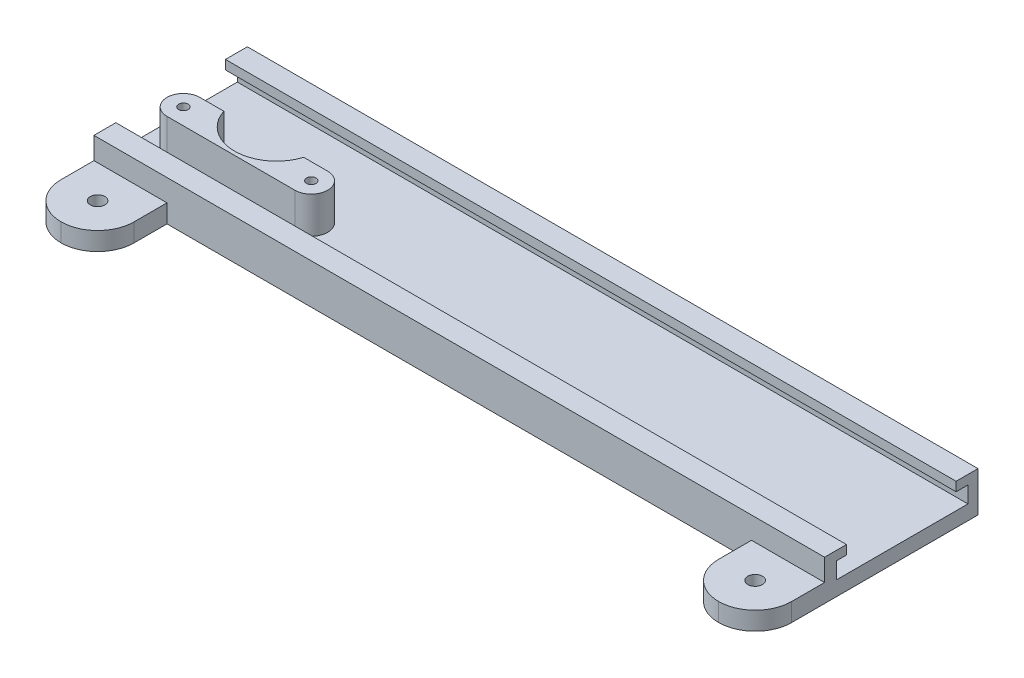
ISO-10303-21;
HEADER;
FILE_DESCRIPTION(('STEP AP214'),'2;1');
FILE_NAME('part.step','',(''),(''),'','','');
FILE_SCHEMA(('AUTOMOTIVE_DESIGN { 1 0 10303 214 1 1 1 1 }'));
ENDSEC;
DATA;
#1=APPLICATION_CONTEXT('core data for automotive mechanical design processes');
#2=APPLICATION_PROTOCOL_DEFINITION('international standard','automotive_design',2000,#1);
#3=PRODUCT_CONTEXT('',#1,'mechanical');
#4=PRODUCT('Part','Part','',(#3));
#5=PRODUCT_RELATED_PRODUCT_CATEGORY('part','',(#4));
#6=PRODUCT_DEFINITION_FORMATION('','',#4);
#7=PRODUCT_DEFINITION_CONTEXT('part definition',#1,'design');
#8=PRODUCT_DEFINITION('design','',#6,#7);
#9=PRODUCT_DEFINITION_SHAPE('','',#8);
#10=(LENGTH_UNIT() NAMED_UNIT(*) SI_UNIT(.MILLI.,.METRE.));
#11=(NAMED_UNIT(*) PLANE_ANGLE_UNIT() SI_UNIT($,.RADIAN.));
#12=(NAMED_UNIT(*) SI_UNIT($,.STERADIAN.) SOLID_ANGLE_UNIT());
#13=UNCERTAINTY_MEASURE_WITH_UNIT(LENGTH_MEASURE(1.E-05),#10,'distance_accuracy_value','');
#14=(GEOMETRIC_REPRESENTATION_CONTEXT(3) GLOBAL_UNCERTAINTY_ASSIGNED_CONTEXT((#13)) GLOBAL_UNIT_ASSIGNED_CONTEXT((#10,
#11,#12)) REPRESENTATION_CONTEXT('',''));
#15=CARTESIAN_POINT('',(0.,0.,0.));
#16=DIRECTION('',(0.,0.,1.));
#17=DIRECTION('',(1.,0.,0.));
#18=AXIS2_PLACEMENT_3D('',#15,#16,#17);
#19=CARTESIAN_POINT('',(-91.5,14.,0.499999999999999));
#20=DIRECTION('',(0.,0.,1.));
#21=DIRECTION('',(1.,0.,0.));
#22=AXIS2_PLACEMENT_3D('',#19,#20,#21);
#23=PLANE('',#22);
#24=DIRECTION('',(-1.,0.,0.));
#25=VECTOR('',#24,1.);
#26=CARTESIAN_POINT('',(-91.5,4.,0.499999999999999));
#27=LINE('',#26,#25);
#28=CARTESIAN_POINT('',(-56.5,4.,0.499999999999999));
#29=VERTEX_POINT('',#28);
#30=CARTESIAN_POINT('',(-63.07,4.,0.499999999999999));
#31=VERTEX_POINT('',#30);
#32=EDGE_CURVE('E224',#29,#31,#27,.T.);
#33=ORIENTED_EDGE('',*,*,#32,.T.);
#34=DIRECTION('',(0.,1.,0.));
#35=VECTOR('',#34,1.);
#36=CARTESIAN_POINT('',(-63.07,-28.4516434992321,0.499999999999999));
#37=LINE('',#36,#35);
#38=CARTESIAN_POINT('',(-63.07,14.,0.499999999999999));
#39=VERTEX_POINT('',#38);
#40=EDGE_CURVE('E214',#31,#39,#37,.T.);
#41=ORIENTED_EDGE('',*,*,#40,.T.);
#42=DIRECTION('',(-1.,0.,0.));
#43=VECTOR('',#42,1.);
#44=CARTESIAN_POINT('',(-91.5,14.,0.499999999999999));
#45=LINE('',#44,#43);
#46=CARTESIAN_POINT('',(-56.5,14.,0.499999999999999));
#47=VERTEX_POINT('',#46);
#48=EDGE_CURVE('E223',#47,#39,#45,.T.);
#49=ORIENTED_EDGE('',*,*,#48,.F.);
#50=DIRECTION('',(0.,-1.,0.));
#51=VECTOR('',#50,1.);
#52=CARTESIAN_POINT('',(-56.5,14.,0.499999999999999));
#53=LINE('',#52,#51);
#54=EDGE_CURVE('E236',#47,#29,#53,.T.);
#55=ORIENTED_EDGE('',*,*,#54,.T.);
#56=EDGE_LOOP('',(#33,#41,#49,#55));
#57=FACE_BOUND('',#56,.T.);
#58=ADVANCED_FACE('F42',(#57),#23,.F.);
#59=CARTESIAN_POINT('',(0.,4.,0.));
#60=DIRECTION('',(0.,-1.,0.));
#61=DIRECTION('',(0.,0.,-1.));
#62=AXIS2_PLACEMENT_3D('',#59,#60,#61);
#63=PLANE('',#62);
#64=DIRECTION('',(0.,0.,1.));
#65=VECTOR('',#64,1.);
#66=CARTESIAN_POINT('',(-100.,4.,21.));
#67=LINE('',#66,#65);
#68=CARTESIAN_POINT('',(-100.,4.,-18.25));
#69=VERTEX_POINT('',#68);
#70=CARTESIAN_POINT('',(-100.,4.,17.75));
#71=VERTEX_POINT('',#70);
#72=EDGE_CURVE('E371',#69,#71,#67,.T.);
#73=ORIENTED_EDGE('',*,*,#72,.T.);
#74=DIRECTION('',(1.,0.,0.));
#75=VECTOR('',#74,1.);
#76=CARTESIAN_POINT('',(-100.,4.,17.75));
#77=LINE('',#76,#75);
#78=CARTESIAN_POINT('',(100.,4.,17.75));
#79=VERTEX_POINT('',#78);
#80=EDGE_CURVE('E298',#71,#79,#77,.T.);
#81=ORIENTED_EDGE('',*,*,#80,.T.);
#82=DIRECTION('',(0.,0.,-1.));
#83=VECTOR('',#82,1.);
#84=CARTESIAN_POINT('',(100.,4.,21.));
#85=LINE('',#84,#83);
#86=CARTESIAN_POINT('',(100.,4.,-18.25));
#87=VERTEX_POINT('',#86);
#88=EDGE_CURVE('E369',#79,#87,#85,.T.);
#89=ORIENTED_EDGE('',*,*,#88,.T.);
#90=DIRECTION('',(1.,0.,0.));
#91=VECTOR('',#90,1.);
#92=CARTESIAN_POINT('',(-100.,4.,-18.25));
#93=LINE('',#92,#91);
#94=EDGE_CURVE('E357',#69,#87,#93,.T.);
#95=ORIENTED_EDGE('',*,*,#94,.F.);
#96=EDGE_LOOP('',(#73,#81,#89,#95));
#97=FACE_BOUND('',#96,.T.);
#98=CARTESIAN_POINT('',(-84.94,4.,0.499999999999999));
#99=VERTEX_POINT('',#98);
#100=CARTESIAN_POINT('',(-91.5,4.,0.499999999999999));
#101=VERTEX_POINT('',#100);
#102=EDGE_CURVE('E249',#99,#101,#27,.T.);
#103=ORIENTED_EDGE('',*,*,#102,.F.);
#104=CARTESIAN_POINT('',(-74.005,4.,-2.97338749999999));
#105=DIRECTION('',(0.,-1.,0.));
#106=DIRECTION('',(0.,0.,-1.));
#107=AXIS2_PLACEMENT_3D('',#104,#105,#106);
#108=CIRCLE('',#107,11.4733885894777);
#109=EDGE_CURVE('E560',#99,#31,#108,.F.);
#110=ORIENTED_EDGE('',*,*,#109,.T.);
#111=ORIENTED_EDGE('',*,*,#32,.F.);
#112=CARTESIAN_POINT('',(-56.5,4.,5.));
#113=DIRECTION('',(0.,1.,0.));
#114=DIRECTION('',(0.,0.,1.));
#115=AXIS2_PLACEMENT_3D('',#112,#113,#114);
#116=CIRCLE('',#115,4.5);
#117=CARTESIAN_POINT('',(-56.5,4.,9.5));
#118=VERTEX_POINT('',#117);
#119=EDGE_CURVE('E246',#118,#29,#116,.T.);
#120=ORIENTED_EDGE('',*,*,#119,.F.);
#121=DIRECTION('',(1.,0.,0.));
#122=VECTOR('',#121,1.);
#123=CARTESIAN_POINT('',(-91.5,4.,9.5));
#124=LINE('',#123,#122);
#125=CARTESIAN_POINT('',(-91.5,4.,9.5));
#126=VERTEX_POINT('',#125);
#127=EDGE_CURVE('E64',#126,#118,#124,.T.);
#128=ORIENTED_EDGE('',*,*,#127,.F.);
#129=CARTESIAN_POINT('',(-91.5,4.,5.));
#130=DIRECTION('',(0.,1.,0.));
#131=DIRECTION('',(0.,0.,1.));
#132=AXIS2_PLACEMENT_3D('',#129,#130,#131);
#133=CIRCLE('',#132,4.5);
#134=EDGE_CURVE('E241',#101,#126,#133,.T.);
#135=ORIENTED_EDGE('',*,*,#134,.F.);
#136=EDGE_LOOP('',(#103,#110,#111,#120,#128,#135));
#137=FACE_BOUND('',#136,.T.);
#138=ADVANCED_FACE('F468',(#97,#137),#63,.F.);
#139=CARTESIAN_POINT('',(-100.,4.,21.));
#140=DIRECTION('',(0.,0.,-1.));
#141=DIRECTION('',(-1.,0.,0.));
#142=AXIS2_PLACEMENT_3D('',#139,#140,#141);
#143=PLANE('',#142);
#144=DIRECTION('',(0.,-1.,0.));
#145=VECTOR('',#144,1.);
#146=CARTESIAN_POINT('',(-80.,5.,21.));
#147=LINE('',#146,#145);
#148=CARTESIAN_POINT('',(-80.,5.,21.));
#149=VERTEX_POINT('',#148);
#150=CARTESIAN_POINT('',(-80.,0.,21.));
#151=VERTEX_POINT('',#150);
#152=EDGE_CURVE('E273',#149,#151,#147,.T.);
#153=ORIENTED_EDGE('',*,*,#152,.T.);
#154=DIRECTION('',(1.,0.,0.));
#155=VECTOR('',#154,1.);
#156=CARTESIAN_POINT('',(-100.,0.,21.));
#157=LINE('',#156,#155);
#158=CARTESIAN_POINT('',(80.,0.,21.));
#159=VERTEX_POINT('',#158);
#160=EDGE_CURVE('E372',#151,#159,#157,.T.);
#161=ORIENTED_EDGE('',*,*,#160,.T.);
#162=DIRECTION('',(0.,-1.,0.));
#163=VECTOR('',#162,1.);
#164=CARTESIAN_POINT('',(80.,5.,21.));
#165=LINE('',#164,#163);
#166=CARTESIAN_POINT('',(80.,5.,21.));
#167=VERTEX_POINT('',#166);
#168=EDGE_CURVE('E292',#167,#159,#165,.T.);
#169=ORIENTED_EDGE('',*,*,#168,.F.);
#170=DIRECTION('',(1.,0.,0.));
#171=VECTOR('',#170,1.);
#172=CARTESIAN_POINT('',(100.,5.,21.));
#173=LINE('',#172,#171);
#174=CARTESIAN_POINT('',(100.,5.,21.));
#175=VERTEX_POINT('',#174);
#176=EDGE_CURVE('E289',#167,#175,#173,.T.);
#177=ORIENTED_EDGE('',*,*,#176,.T.);
#178=DIRECTION('',(0.,-1.,0.));
#179=VECTOR('',#178,1.);
#180=CARTESIAN_POINT('',(100.,4.,21.));
#181=LINE('',#180,#179);
#182=CARTESIAN_POINT('',(100.,11.,21.));
#183=VERTEX_POINT('',#182);
#184=EDGE_CURVE('E374',#183,#175,#181,.T.);
#185=ORIENTED_EDGE('',*,*,#184,.F.);
#186=DIRECTION('',(1.,0.,0.));
#187=VECTOR('',#186,1.);
#188=CARTESIAN_POINT('',(-100.,11.,21.));
#189=LINE('',#188,#187);
#190=CARTESIAN_POINT('',(-100.,11.,21.));
#191=VERTEX_POINT('',#190);
#192=EDGE_CURVE('E297',#191,#183,#189,.T.);
#193=ORIENTED_EDGE('',*,*,#192,.F.);
#194=DIRECTION('',(0.,-1.,0.));
#195=VECTOR('',#194,1.);
#196=CARTESIAN_POINT('',(-100.,4.,21.));
#197=LINE('',#196,#195);
#198=CARTESIAN_POINT('',(-100.,5.,21.));
#199=VERTEX_POINT('',#198);
#200=EDGE_CURVE('E384',#191,#199,#197,.T.);
#201=ORIENTED_EDGE('',*,*,#200,.T.);
#202=DIRECTION('',(-1.,0.,0.));
#203=VECTOR('',#202,1.);
#204=CARTESIAN_POINT('',(-100.,5.,21.));
#205=LINE('',#204,#203);
#206=EDGE_CURVE('E268',#149,#199,#205,.T.);
#207=ORIENTED_EDGE('',*,*,#206,.F.);
#208=EDGE_LOOP('',(#153,#161,#169,#177,#185,#193,#201,#207));
#209=FACE_BOUND('',#208,.T.);
#210=ADVANCED_FACE('F447',(#209),#143,.F.);
#211=CARTESIAN_POINT('',(100.,4.,21.));
#212=DIRECTION('',(-1.,0.,0.));
#213=DIRECTION('',(0.,0.,1.));
#214=AXIS2_PLACEMENT_3D('',#211,#212,#213);
#215=PLANE('',#214);
#216=DIRECTION('',(0.,0.,1.));
#217=VECTOR('',#216,1.);
#218=CARTESIAN_POINT('',(100.,5.,21.));
#219=LINE('',#218,#217);
#220=CARTESIAN_POINT('',(100.,5.,30.));
#221=VERTEX_POINT('',#220);
#222=EDGE_CURVE('E284',#175,#221,#219,.T.);
#223=ORIENTED_EDGE('',*,*,#222,.T.);
#224=DIRECTION('',(0.,-1.,0.));
#225=VECTOR('',#224,1.);
#226=CARTESIAN_POINT('',(100.,0.,30.));
#227=LINE('',#226,#225);
#228=CARTESIAN_POINT('',(100.,0.,30.));
#229=VERTEX_POINT('',#228);
#230=EDGE_CURVE('E392',#221,#229,#227,.T.);
#231=ORIENTED_EDGE('',*,*,#230,.T.);
#232=DIRECTION('',(0.,0.,-1.));
#233=VECTOR('',#232,1.);
#234=CARTESIAN_POINT('',(100.,0.,21.));
#235=LINE('',#234,#233);
#236=CARTESIAN_POINT('',(100.,0.,-21.));
#237=VERTEX_POINT('',#236);
#238=EDGE_CURVE('E360',#229,#237,#235,.T.);
#239=ORIENTED_EDGE('',*,*,#238,.T.);
#240=DIRECTION('',(0.,-1.,0.));
#241=VECTOR('',#240,1.);
#242=CARTESIAN_POINT('',(100.,4.,-21.));
#243=LINE('',#242,#241);
#244=CARTESIAN_POINT('',(100.,11.,-21.));
#245=VERTEX_POINT('',#244);
#246=EDGE_CURVE('E389',#245,#237,#243,.T.);
#247=ORIENTED_EDGE('',*,*,#246,.F.);
#248=DIRECTION('',(0.,0.,1.));
#249=VECTOR('',#248,1.);
#250=CARTESIAN_POINT('',(100.,11.,-21.));
#251=LINE('',#250,#249);
#252=CARTESIAN_POINT('',(100.,11.,-15.));
#253=VERTEX_POINT('',#252);
#254=EDGE_CURVE('E322',#245,#253,#251,.T.);
#255=ORIENTED_EDGE('',*,*,#254,.T.);
#256=DIRECTION('',(0.,-1.,0.));
#257=VECTOR('',#256,1.);
#258=CARTESIAN_POINT('',(100.,11.,-15.));
#259=LINE('',#258,#257);
#260=CARTESIAN_POINT('',(100.,8.5,-15.));
#261=VERTEX_POINT('',#260);
#262=EDGE_CURVE('E349',#253,#261,#259,.T.);
#263=ORIENTED_EDGE('',*,*,#262,.T.);
#264=DIRECTION('',(0.,0.,-1.));
#265=VECTOR('',#264,1.);
#266=CARTESIAN_POINT('',(100.,8.5,-15.));
#267=LINE('',#266,#265);
#268=CARTESIAN_POINT('',(100.,8.5,-18.25));
#269=VERTEX_POINT('',#268);
#270=EDGE_CURVE('E352',#261,#269,#267,.T.);
#271=ORIENTED_EDGE('',*,*,#270,.T.);
#272=DIRECTION('',(0.,-1.,0.));
#273=VECTOR('',#272,1.);
#274=CARTESIAN_POINT('',(100.,8.5,-18.25));
#275=LINE('',#274,#273);
#276=EDGE_CURVE('E337',#269,#87,#275,.T.);
#277=ORIENTED_EDGE('',*,*,#276,.T.);
#278=ORIENTED_EDGE('',*,*,#88,.F.);
#279=DIRECTION('',(0.,1.,0.));
#280=VECTOR('',#279,1.);
#281=CARTESIAN_POINT('',(100.,8.5,17.75));
#282=LINE('',#281,#280);
#283=CARTESIAN_POINT('',(100.,8.5,17.75));
#284=VERTEX_POINT('',#283);
#285=EDGE_CURVE('E319',#79,#284,#282,.T.);
#286=ORIENTED_EDGE('',*,*,#285,.T.);
#287=DIRECTION('',(0.,0.,-1.));
#288=VECTOR('',#287,1.);
#289=CARTESIAN_POINT('',(100.,8.5,15.));
#290=LINE('',#289,#288);
#291=CARTESIAN_POINT('',(100.,8.5,15.));
#292=VERTEX_POINT('',#291);
#293=EDGE_CURVE('E316',#284,#292,#290,.T.);
#294=ORIENTED_EDGE('',*,*,#293,.T.);
#295=DIRECTION('',(0.,1.,0.));
#296=VECTOR('',#295,1.);
#297=CARTESIAN_POINT('',(100.,11.,15.));
#298=LINE('',#297,#296);
#299=CARTESIAN_POINT('',(100.,11.,15.));
#300=VERTEX_POINT('',#299);
#301=EDGE_CURVE('E312',#292,#300,#298,.T.);
#302=ORIENTED_EDGE('',*,*,#301,.T.);
#303=DIRECTION('',(0.,0.,1.));
#304=VECTOR('',#303,1.);
#305=CARTESIAN_POINT('',(100.,11.,21.));
#306=LINE('',#305,#304);
#307=EDGE_CURVE('E309',#300,#183,#306,.T.);
#308=ORIENTED_EDGE('',*,*,#307,.T.);
#309=ORIENTED_EDGE('',*,*,#184,.T.);
#310=EDGE_LOOP('',(#223,#231,#239,#247,#255,#263,#271,#277,#278,#286,#294,#302,#308,#309));
#311=FACE_BOUND('',#310,.T.);
#312=ADVANCED_FACE('F470',(#311),#215,.F.);
#313=CARTESIAN_POINT('',(-100.,4.,-21.));
#314=DIRECTION('',(0.,0.,1.));
#315=DIRECTION('',(1.,0.,0.));
#316=AXIS2_PLACEMENT_3D('',#313,#314,#315);
#317=PLANE('',#316);
#318=DIRECTION('',(-1.,0.,0.));
#319=VECTOR('',#318,1.);
#320=CARTESIAN_POINT('',(-100.,0.,-21.));
#321=LINE('',#320,#319);
#322=CARTESIAN_POINT('',(-100.,0.,-21.));
#323=VERTEX_POINT('',#322);
#324=EDGE_CURVE('E376',#237,#323,#321,.T.);
#325=ORIENTED_EDGE('',*,*,#324,.T.);
#326=DIRECTION('',(0.,-1.,0.));
#327=VECTOR('',#326,1.);
#328=CARTESIAN_POINT('',(-100.,4.,-21.));
#329=LINE('',#328,#327);
#330=CARTESIAN_POINT('',(-100.,11.,-21.));
#331=VERTEX_POINT('',#330);
#332=EDGE_CURVE('E386',#331,#323,#329,.T.);
#333=ORIENTED_EDGE('',*,*,#332,.F.);
#334=DIRECTION('',(1.,0.,0.));
#335=VECTOR('',#334,1.);
#336=CARTESIAN_POINT('',(-100.,11.,-21.));
#337=LINE('',#336,#335);
#338=EDGE_CURVE('E346',#331,#245,#337,.T.);
#339=ORIENTED_EDGE('',*,*,#338,.T.);
#340=ORIENTED_EDGE('',*,*,#246,.T.);
#341=EDGE_LOOP('',(#325,#333,#339,#340));
#342=FACE_BOUND('',#341,.T.);
#343=ADVANCED_FACE('F490',(#342),#317,.F.);
#344=CARTESIAN_POINT('',(-100.,4.,21.));
#345=DIRECTION('',(1.,0.,0.));
#346=DIRECTION('',(0.,0.,-1.));
#347=AXIS2_PLACEMENT_3D('',#344,#345,#346);
#348=PLANE('',#347);
#349=DIRECTION('',(0.,0.,1.));
#350=VECTOR('',#349,1.);
#351=CARTESIAN_POINT('',(-100.,0.,21.));
#352=LINE('',#351,#350);
#353=CARTESIAN_POINT('',(-100.,0.,30.));
#354=VERTEX_POINT('',#353);
#355=EDGE_CURVE('E378',#323,#354,#352,.T.);
#356=ORIENTED_EDGE('',*,*,#355,.T.);
#357=DIRECTION('',(0.,-1.,0.));
#358=VECTOR('',#357,1.);
#359=CARTESIAN_POINT('',(-100.,4.,30.));
#360=LINE('',#359,#358);
#361=CARTESIAN_POINT('',(-100.,5.,30.));
#362=VERTEX_POINT('',#361);
#363=EDGE_CURVE('E414',#354,#362,#360,.F.);
#364=ORIENTED_EDGE('',*,*,#363,.T.);
#365=DIRECTION('',(0.,0.,1.));
#366=VECTOR('',#365,1.);
#367=CARTESIAN_POINT('',(-100.,5.,21.));
#368=LINE('',#367,#366);
#369=EDGE_CURVE('E265',#199,#362,#368,.T.);
#370=ORIENTED_EDGE('',*,*,#369,.F.);
#371=ORIENTED_EDGE('',*,*,#200,.F.);
#372=DIRECTION('',(0.,0.,1.));
#373=VECTOR('',#372,1.);
#374=CARTESIAN_POINT('',(-100.,11.,21.));
#375=LINE('',#374,#373);
#376=CARTESIAN_POINT('',(-100.,11.,15.));
#377=VERTEX_POINT('',#376);
#378=EDGE_CURVE('E300',#377,#191,#375,.T.);
#379=ORIENTED_EDGE('',*,*,#378,.F.);
#380=DIRECTION('',(0.,1.,0.));
#381=VECTOR('',#380,1.);
#382=CARTESIAN_POINT('',(-100.,11.,15.));
#383=LINE('',#382,#381);
#384=CARTESIAN_POINT('',(-100.,8.5,15.));
#385=VERTEX_POINT('',#384);
#386=EDGE_CURVE('E325',#385,#377,#383,.T.);
#387=ORIENTED_EDGE('',*,*,#386,.F.);
#388=DIRECTION('',(0.,0.,-1.));
#389=VECTOR('',#388,1.);
#390=CARTESIAN_POINT('',(-100.,8.5,15.));
#391=LINE('',#390,#389);
#392=CARTESIAN_POINT('',(-100.,8.5,17.75));
#393=VERTEX_POINT('',#392);
#394=EDGE_CURVE('E328',#393,#385,#391,.T.);
#395=ORIENTED_EDGE('',*,*,#394,.F.);
#396=DIRECTION('',(0.,1.,0.));
#397=VECTOR('',#396,1.);
#398=CARTESIAN_POINT('',(-100.,8.5,17.75));
#399=LINE('',#398,#397);
#400=EDGE_CURVE('E313',#71,#393,#399,.T.);
#401=ORIENTED_EDGE('',*,*,#400,.F.);
#402=ORIENTED_EDGE('',*,*,#72,.F.);
#403=DIRECTION('',(0.,-1.,0.));
#404=VECTOR('',#403,1.);
#405=CARTESIAN_POINT('',(-100.,8.5,-18.25));
#406=LINE('',#405,#404);
#407=CARTESIAN_POINT('',(-100.,8.5,-18.25));
#408=VERTEX_POINT('',#407);
#409=EDGE_CURVE('E343',#408,#69,#406,.T.);
#410=ORIENTED_EDGE('',*,*,#409,.F.);
#411=DIRECTION('',(0.,0.,-1.));
#412=VECTOR('',#411,1.);
#413=CARTESIAN_POINT('',(-100.,8.5,-15.));
#414=LINE('',#413,#412);
#415=CARTESIAN_POINT('',(-100.,8.5,-15.));
#416=VERTEX_POINT('',#415);
#417=EDGE_CURVE('E340',#416,#408,#414,.T.);
#418=ORIENTED_EDGE('',*,*,#417,.F.);
#419=DIRECTION('',(0.,-1.,0.));
#420=VECTOR('',#419,1.);
#421=CARTESIAN_POINT('',(-100.,11.,-15.));
#422=LINE('',#421,#420);
#423=CARTESIAN_POINT('',(-100.,11.,-15.));
#424=VERTEX_POINT('',#423);
#425=EDGE_CURVE('E336',#424,#416,#422,.T.);
#426=ORIENTED_EDGE('',*,*,#425,.F.);
#427=DIRECTION('',(0.,0.,1.));
#428=VECTOR('',#427,1.);
#429=CARTESIAN_POINT('',(-100.,11.,-21.));
#430=LINE('',#429,#428);
#431=EDGE_CURVE('E333',#331,#424,#430,.T.);
#432=ORIENTED_EDGE('',*,*,#431,.F.);
#433=ORIENTED_EDGE('',*,*,#332,.T.);
#434=EDGE_LOOP('',(#356,#364,#370,#371,#379,#387,#395,#401,#402,#410,#418,#426,#432,#433));
#435=FACE_BOUND('',#434,.T.);
#436=ADVANCED_FACE('F445',(#435),#348,.F.);
#437=CARTESIAN_POINT('',(0.,0.,0.));
#438=DIRECTION('',(0.,-1.,0.));
#439=DIRECTION('',(0.,0.,-1.));
#440=AXIS2_PLACEMENT_3D('',#437,#438,#439);
#441=PLANE('',#440);
#442=CARTESIAN_POINT('',(-90.,0.,30.));
#443=DIRECTION('',(0.,-1.,0.));
#444=DIRECTION('',(0.,0.,1.));
#445=AXIS2_PLACEMENT_3D('',#442,#443,#444);
#446=CIRCLE('',#445,2.);
#447=CARTESIAN_POINT('',(-90.,0.,32.));
#448=VERTEX_POINT('',#447);
#449=EDGE_CURVE('E259',#448,#448,#446,.T.);
#450=ORIENTED_EDGE('',*,*,#449,.F.);
#451=EDGE_LOOP('',(#450));
#452=FACE_BOUND('',#451,.T.);
#453=CARTESIAN_POINT('',(90.,0.,30.));
#454=DIRECTION('',(0.,1.,0.));
#455=DIRECTION('',(0.,0.,1.));
#456=AXIS2_PLACEMENT_3D('',#453,#454,#455);
#457=CIRCLE('',#456,2.);
#458=CARTESIAN_POINT('',(90.,0.,32.));
#459=VERTEX_POINT('',#458);
#460=EDGE_CURVE('E278',#459,#459,#457,.T.);
#461=ORIENTED_EDGE('',*,*,#460,.T.);
#462=EDGE_LOOP('',(#461));
#463=FACE_BOUND('',#462,.T.);
#464=DIRECTION('',(0.,0.,-1.));
#465=VECTOR('',#464,1.);
#466=CARTESIAN_POINT('',(-80.,0.,21.));
#467=LINE('',#466,#465);
#468=CARTESIAN_POINT('',(-80.,0.,30.));
#469=VERTEX_POINT('',#468);
#470=EDGE_CURVE('E262',#469,#151,#467,.T.);
#471=ORIENTED_EDGE('',*,*,#470,.F.);
#472=CARTESIAN_POINT('',(-90.,0.,30.));
#473=DIRECTION('',(0.,-1.,0.));
#474=DIRECTION('',(0.,0.,-1.));
#475=AXIS2_PLACEMENT_3D('',#472,#473,#474);
#476=CIRCLE('',#475,10.);
#477=CARTESIAN_POINT('',(-90.,0.,40.));
#478=VERTEX_POINT('',#477);
#479=EDGE_CURVE('E421',#469,#478,#476,.T.);
#480=ORIENTED_EDGE('',*,*,#479,.T.);
#481=CARTESIAN_POINT('',(-90.,0.,30.));
#482=DIRECTION('',(0.,-1.,0.));
#483=DIRECTION('',(0.,0.,-1.));
#484=AXIS2_PLACEMENT_3D('',#481,#482,#483);
#485=CIRCLE('',#484,10.);
#486=EDGE_CURVE('E412',#478,#354,#485,.T.);
#487=ORIENTED_EDGE('',*,*,#486,.T.);
#488=ORIENTED_EDGE('',*,*,#355,.F.);
#489=ORIENTED_EDGE('',*,*,#324,.F.);
#490=ORIENTED_EDGE('',*,*,#238,.F.);
#491=CARTESIAN_POINT('',(90.,0.,30.));
#492=DIRECTION('',(0.,-1.,0.));
#493=DIRECTION('',(0.,0.,-1.));
#494=AXIS2_PLACEMENT_3D('',#491,#492,#493);
#495=CIRCLE('',#494,10.);
#496=CARTESIAN_POINT('',(90.,0.,40.));
#497=VERTEX_POINT('',#496);
#498=EDGE_CURVE('E395',#229,#497,#495,.T.);
#499=ORIENTED_EDGE('',*,*,#498,.T.);
#500=CARTESIAN_POINT('',(90.,0.,30.));
#501=DIRECTION('',(0.,-1.,0.));
#502=DIRECTION('',(0.,0.,-1.));
#503=AXIS2_PLACEMENT_3D('',#500,#501,#502);
#504=CIRCLE('',#503,10.);
#505=CARTESIAN_POINT('',(80.,0.,30.));
#506=VERTEX_POINT('',#505);
#507=EDGE_CURVE('E403',#497,#506,#504,.T.);
#508=ORIENTED_EDGE('',*,*,#507,.T.);
#509=DIRECTION('',(0.,0.,-1.));
#510=VECTOR('',#509,1.);
#511=CARTESIAN_POINT('',(80.,0.,21.));
#512=LINE('',#511,#510);
#513=EDGE_CURVE('E281',#506,#159,#512,.T.);
#514=ORIENTED_EDGE('',*,*,#513,.T.);
#515=ORIENTED_EDGE('',*,*,#160,.F.);
#516=EDGE_LOOP('',(#471,#480,#487,#488,#489,#490,#499,#508,#514,#515));
#517=FACE_BOUND('',#516,.T.);
#518=ADVANCED_FACE('F437',(#452,#463,#517),#441,.T.);
#519=CARTESIAN_POINT('',(-100.,8.5,-18.25));
#520=DIRECTION('',(0.,0.,1.));
#521=DIRECTION('',(0.,-1.,0.));
#522=AXIS2_PLACEMENT_3D('',#519,#520,#521);
#523=PLANE('',#522);
#524=ORIENTED_EDGE('',*,*,#276,.F.);
#525=DIRECTION('',(1.,0.,0.));
#526=VECTOR('',#525,1.);
#527=CARTESIAN_POINT('',(-100.,8.5,-18.25));
#528=LINE('',#527,#526);
#529=EDGE_CURVE('E361',#408,#269,#528,.T.);
#530=ORIENTED_EDGE('',*,*,#529,.F.);
#531=ORIENTED_EDGE('',*,*,#409,.T.);
#532=ORIENTED_EDGE('',*,*,#94,.T.);
#533=EDGE_LOOP('',(#524,#530,#531,#532));
#534=FACE_BOUND('',#533,.T.);
#535=ADVANCED_FACE('F474',(#534),#523,.T.);
#536=CARTESIAN_POINT('',(-100.,8.5,-15.));
#537=DIRECTION('',(0.,-1.,0.));
#538=DIRECTION('',(0.,0.,-1.));
#539=AXIS2_PLACEMENT_3D('',#536,#537,#538);
#540=PLANE('',#539);
#541=ORIENTED_EDGE('',*,*,#270,.F.);
#542=DIRECTION('',(1.,0.,0.));
#543=VECTOR('',#542,1.);
#544=CARTESIAN_POINT('',(-100.,8.5,-15.));
#545=LINE('',#544,#543);
#546=EDGE_CURVE('E363',#416,#261,#545,.T.);
#547=ORIENTED_EDGE('',*,*,#546,.F.);
#548=ORIENTED_EDGE('',*,*,#417,.T.);
#549=ORIENTED_EDGE('',*,*,#529,.T.);
#550=EDGE_LOOP('',(#541,#547,#548,#549));
#551=FACE_BOUND('',#550,.T.);
#552=ADVANCED_FACE('F814',(#551),#540,.T.);
#553=CARTESIAN_POINT('',(-100.,11.,-15.));
#554=DIRECTION('',(0.,0.,1.));
#555=DIRECTION('',(1.,0.,0.));
#556=AXIS2_PLACEMENT_3D('',#553,#554,#555);
#557=PLANE('',#556);
#558=ORIENTED_EDGE('',*,*,#262,.F.);
#559=DIRECTION('',(1.,0.,0.));
#560=VECTOR('',#559,1.);
#561=CARTESIAN_POINT('',(-100.,11.,-15.));
#562=LINE('',#561,#560);
#563=EDGE_CURVE('E365',#424,#253,#562,.T.);
#564=ORIENTED_EDGE('',*,*,#563,.F.);
#565=ORIENTED_EDGE('',*,*,#425,.T.);
#566=ORIENTED_EDGE('',*,*,#546,.T.);
#567=EDGE_LOOP('',(#558,#564,#565,#566));
#568=FACE_BOUND('',#567,.T.);
#569=ADVANCED_FACE('F482',(#568),#557,.T.);
#570=CARTESIAN_POINT('',(-100.,11.,-21.));
#571=DIRECTION('',(0.,1.,0.));
#572=DIRECTION('',(0.,0.,1.));
#573=AXIS2_PLACEMENT_3D('',#570,#571,#572);
#574=PLANE('',#573);
#575=ORIENTED_EDGE('',*,*,#254,.F.);
#576=ORIENTED_EDGE('',*,*,#338,.F.);
#577=ORIENTED_EDGE('',*,*,#431,.T.);
#578=ORIENTED_EDGE('',*,*,#563,.T.);
#579=EDGE_LOOP('',(#575,#576,#577,#578));
#580=FACE_BOUND('',#579,.T.);
#581=ADVANCED_FACE('F485',(#580),#574,.T.);
#582=CARTESIAN_POINT('',(-100.,11.,21.));
#583=DIRECTION('',(0.,1.,0.));
#584=DIRECTION('',(0.,0.,1.));
#585=AXIS2_PLACEMENT_3D('',#582,#583,#584);
#586=PLANE('',#585);
#587=ORIENTED_EDGE('',*,*,#307,.F.);
#588=DIRECTION('',(1.,0.,0.));
#589=VECTOR('',#588,1.);
#590=CARTESIAN_POINT('',(-100.,11.,15.));
#591=LINE('',#590,#589);
#592=EDGE_CURVE('E305',#377,#300,#591,.T.);
#593=ORIENTED_EDGE('',*,*,#592,.F.);
#594=ORIENTED_EDGE('',*,*,#378,.T.);
#595=ORIENTED_EDGE('',*,*,#192,.T.);
#596=EDGE_LOOP('',(#587,#593,#594,#595));
#597=FACE_BOUND('',#596,.T.);
#598=ADVANCED_FACE('F508',(#597),#586,.T.);
#599=CARTESIAN_POINT('',(-100.,11.,15.));
#600=DIRECTION('',(0.,0.,-1.));
#601=DIRECTION('',(0.,1.,0.));
#602=AXIS2_PLACEMENT_3D('',#599,#600,#601);
#603=PLANE('',#602);
#604=ORIENTED_EDGE('',*,*,#301,.F.);
#605=DIRECTION('',(1.,0.,0.));
#606=VECTOR('',#605,1.);
#607=CARTESIAN_POINT('',(-100.,8.5,15.));
#608=LINE('',#607,#606);
#609=EDGE_CURVE('E303',#385,#292,#608,.T.);
#610=ORIENTED_EDGE('',*,*,#609,.F.);
#611=ORIENTED_EDGE('',*,*,#386,.T.);
#612=ORIENTED_EDGE('',*,*,#592,.T.);
#613=EDGE_LOOP('',(#604,#610,#611,#612));
#614=FACE_BOUND('',#613,.T.);
#615=ADVANCED_FACE('F455',(#614),#603,.T.);
#616=CARTESIAN_POINT('',(-100.,8.5,15.));
#617=DIRECTION('',(0.,-1.,0.));
#618=DIRECTION('',(0.,0.,-1.));
#619=AXIS2_PLACEMENT_3D('',#616,#617,#618);
#620=PLANE('',#619);
#621=ORIENTED_EDGE('',*,*,#293,.F.);
#622=DIRECTION('',(1.,0.,0.));
#623=VECTOR('',#622,1.);
#624=CARTESIAN_POINT('',(-100.,8.5,17.75));
#625=LINE('',#624,#623);
#626=EDGE_CURVE('E301',#393,#284,#625,.T.);
#627=ORIENTED_EDGE('',*,*,#626,.F.);
#628=ORIENTED_EDGE('',*,*,#394,.T.);
#629=ORIENTED_EDGE('',*,*,#609,.T.);
#630=EDGE_LOOP('',(#621,#627,#628,#629));
#631=FACE_BOUND('',#630,.T.);
#632=ADVANCED_FACE('F459',(#631),#620,.T.);
#633=CARTESIAN_POINT('',(-100.,8.5,17.75));
#634=DIRECTION('',(0.,0.,-1.));
#635=DIRECTION('',(-1.,0.,0.));
#636=AXIS2_PLACEMENT_3D('',#633,#634,#635);
#637=PLANE('',#636);
#638=ORIENTED_EDGE('',*,*,#285,.F.);
#639=ORIENTED_EDGE('',*,*,#80,.F.);
#640=ORIENTED_EDGE('',*,*,#400,.T.);
#641=ORIENTED_EDGE('',*,*,#626,.T.);
#642=EDGE_LOOP('',(#638,#639,#640,#641));
#643=FACE_BOUND('',#642,.T.);
#644=ADVANCED_FACE('F465',(#643),#637,.T.);
#645=CARTESIAN_POINT('',(80.,5.,21.));
#646=DIRECTION('',(-1.,0.,0.));
#647=DIRECTION('',(0.,0.,1.));
#648=AXIS2_PLACEMENT_3D('',#645,#646,#647);
#649=PLANE('',#648);
#650=ORIENTED_EDGE('',*,*,#513,.F.);
#651=DIRECTION('',(0.,-1.,0.));
#652=VECTOR('',#651,1.);
#653=CARTESIAN_POINT('',(80.,5.,30.));
#654=LINE('',#653,#652);
#655=CARTESIAN_POINT('',(80.,5.,30.));
#656=VERTEX_POINT('',#655);
#657=EDGE_CURVE('E405',#506,#656,#654,.F.);
#658=ORIENTED_EDGE('',*,*,#657,.T.);
#659=DIRECTION('',(0.,0.,-1.));
#660=VECTOR('',#659,1.);
#661=CARTESIAN_POINT('',(80.,5.,21.));
#662=LINE('',#661,#660);
#663=EDGE_CURVE('E287',#656,#167,#662,.T.);
#664=ORIENTED_EDGE('',*,*,#663,.T.);
#665=ORIENTED_EDGE('',*,*,#168,.T.);
#666=EDGE_LOOP('',(#650,#658,#664,#665));
#667=FACE_BOUND('',#666,.T.);
#668=ADVANCED_FACE('F500',(#667),#649,.T.);
#669=CARTESIAN_POINT('',(0.,5.,0.));
#670=DIRECTION('',(0.,-1.,0.));
#671=DIRECTION('',(0.,0.,-1.));
#672=AXIS2_PLACEMENT_3D('',#669,#670,#671);
#673=PLANE('',#672);
#674=CARTESIAN_POINT('',(90.,5.,30.));
#675=DIRECTION('',(0.,1.,0.));
#676=DIRECTION('',(0.,0.,1.));
#677=AXIS2_PLACEMENT_3D('',#674,#675,#676);
#678=CIRCLE('',#677,2.);
#679=CARTESIAN_POINT('',(90.,5.,32.));
#680=VERTEX_POINT('',#679);
#681=EDGE_CURVE('E277',#680,#680,#678,.T.);
#682=ORIENTED_EDGE('',*,*,#681,.F.);
#683=EDGE_LOOP('',(#682));
#684=FACE_BOUND('',#683,.T.);
#685=ORIENTED_EDGE('',*,*,#663,.F.);
#686=CARTESIAN_POINT('',(90.,5.,30.));
#687=DIRECTION('',(0.,-1.,0.));
#688=DIRECTION('',(0.,0.,-1.));
#689=AXIS2_PLACEMENT_3D('',#686,#687,#688);
#690=CIRCLE('',#689,10.);
#691=CARTESIAN_POINT('',(90.,5.,40.));
#692=VERTEX_POINT('',#691);
#693=EDGE_CURVE('E407',#656,#692,#690,.F.);
#694=ORIENTED_EDGE('',*,*,#693,.T.);
#695=CARTESIAN_POINT('',(90.,5.,30.));
#696=DIRECTION('',(0.,-1.,0.));
#697=DIRECTION('',(0.,0.,-1.));
#698=AXIS2_PLACEMENT_3D('',#695,#696,#697);
#699=CIRCLE('',#698,10.);
#700=EDGE_CURVE('E401',#692,#221,#699,.F.);
#701=ORIENTED_EDGE('',*,*,#700,.T.);
#702=ORIENTED_EDGE('',*,*,#222,.F.);
#703=ORIENTED_EDGE('',*,*,#176,.F.);
#704=EDGE_LOOP('',(#685,#694,#701,#702,#703));
#705=FACE_BOUND('',#704,.T.);
#706=ADVANCED_FACE('F506',(#684,#705),#673,.F.);
#707=CARTESIAN_POINT('',(90.,4.,30.));
#708=DIRECTION('',(0.,1.,0.));
#709=DIRECTION('',(0.,0.,1.));
#710=AXIS2_PLACEMENT_3D('',#707,#708,#709);
#711=CYLINDRICAL_SURFACE('',#710,10.);
#712=ORIENTED_EDGE('',*,*,#700,.F.);
#713=DIRECTION('',(0.,-1.,0.));
#714=VECTOR('',#713,1.);
#715=CARTESIAN_POINT('',(90.,5.,40.));
#716=LINE('',#715,#714);
#717=EDGE_CURVE('E398',#497,#692,#716,.F.);
#718=ORIENTED_EDGE('',*,*,#717,.F.);
#719=ORIENTED_EDGE('',*,*,#498,.F.);
#720=ORIENTED_EDGE('',*,*,#230,.F.);
#721=EDGE_LOOP('',(#712,#718,#719,#720));
#722=FACE_BOUND('',#721,.T.);
#723=ADVANCED_FACE('F494',(#722),#711,.T.);
#724=CARTESIAN_POINT('',(90.,5.,30.));
#725=DIRECTION('',(0.,-1.,0.));
#726=DIRECTION('',(0.,0.,-1.));
#727=AXIS2_PLACEMENT_3D('',#724,#725,#726);
#728=CYLINDRICAL_SURFACE('',#727,10.);
#729=ORIENTED_EDGE('',*,*,#693,.F.);
#730=ORIENTED_EDGE('',*,*,#657,.F.);
#731=ORIENTED_EDGE('',*,*,#507,.F.);
#732=ORIENTED_EDGE('',*,*,#717,.T.);
#733=EDGE_LOOP('',(#729,#730,#731,#732));
#734=FACE_BOUND('',#733,.T.);
#735=ADVANCED_FACE('F504',(#734),#728,.T.);
#736=CARTESIAN_POINT('',(90.,0.,30.));
#737=DIRECTION('',(0.,1.,0.));
#738=DIRECTION('',(0.,0.,1.));
#739=AXIS2_PLACEMENT_3D('',#736,#737,#738);
#740=CYLINDRICAL_SURFACE('',#739,2.);
#741=ORIENTED_EDGE('',*,*,#460,.F.);
#742=EDGE_LOOP('',(#741));
#743=FACE_BOUND('',#742,.T.);
#744=ORIENTED_EDGE('',*,*,#681,.T.);
#745=EDGE_LOOP('',(#744));
#746=FACE_BOUND('',#745,.T.);
#747=ADVANCED_FACE('F681',(#743,#746),#740,.F.);
#748=CARTESIAN_POINT('',(-80.,5.,21.));
#749=DIRECTION('',(-1.,0.,0.));
#750=DIRECTION('',(0.,0.,1.));
#751=AXIS2_PLACEMENT_3D('',#748,#749,#750);
#752=PLANE('',#751);
#753=DIRECTION('',(0.,0.,-1.));
#754=VECTOR('',#753,1.);
#755=CARTESIAN_POINT('',(-80.,5.,21.));
#756=LINE('',#755,#754);
#757=CARTESIAN_POINT('',(-80.,5.,30.));
#758=VERTEX_POINT('',#757);
#759=EDGE_CURVE('E271',#758,#149,#756,.T.);
#760=ORIENTED_EDGE('',*,*,#759,.F.);
#761=DIRECTION('',(0.,-1.,0.));
#762=VECTOR('',#761,1.);
#763=CARTESIAN_POINT('',(-80.,5.,30.));
#764=LINE('',#763,#762);
#765=EDGE_CURVE('E418',#758,#469,#764,.T.);
#766=ORIENTED_EDGE('',*,*,#765,.T.);
#767=ORIENTED_EDGE('',*,*,#470,.T.);
#768=ORIENTED_EDGE('',*,*,#152,.F.);
#769=EDGE_LOOP('',(#760,#766,#767,#768));
#770=FACE_BOUND('',#769,.T.);
#771=ADVANCED_FACE('F433',(#770),#752,.F.);
#772=CARTESIAN_POINT('',(0.,5.,0.));
#773=DIRECTION('',(0.,-1.,0.));
#774=DIRECTION('',(0.,0.,-1.));
#775=AXIS2_PLACEMENT_3D('',#772,#773,#774);
#776=PLANE('',#775);
#777=CARTESIAN_POINT('',(-90.,5.,30.));
#778=DIRECTION('',(0.,-1.,0.));
#779=DIRECTION('',(0.,0.,1.));
#780=AXIS2_PLACEMENT_3D('',#777,#778,#779);
#781=CIRCLE('',#780,2.);
#782=CARTESIAN_POINT('',(-90.,5.,32.));
#783=VERTEX_POINT('',#782);
#784=EDGE_CURVE('E258',#783,#783,#781,.T.);
#785=ORIENTED_EDGE('',*,*,#784,.T.);
#786=EDGE_LOOP('',(#785));
#787=FACE_BOUND('',#786,.T.);
#788=CARTESIAN_POINT('',(-90.,5.,30.));
#789=DIRECTION('',(0.,-1.,0.));
#790=DIRECTION('',(0.,0.,-1.));
#791=AXIS2_PLACEMENT_3D('',#788,#789,#790);
#792=CIRCLE('',#791,10.);
#793=CARTESIAN_POINT('',(-90.,5.,40.));
#794=VERTEX_POINT('',#793);
#795=EDGE_CURVE('E416',#362,#794,#792,.F.);
#796=ORIENTED_EDGE('',*,*,#795,.T.);
#797=CARTESIAN_POINT('',(-90.,5.,30.));
#798=DIRECTION('',(0.,-1.,0.));
#799=DIRECTION('',(0.,0.,-1.));
#800=AXIS2_PLACEMENT_3D('',#797,#798,#799);
#801=CIRCLE('',#800,10.);
#802=EDGE_CURVE('E50',#794,#758,#801,.F.);
#803=ORIENTED_EDGE('',*,*,#802,.T.);
#804=ORIENTED_EDGE('',*,*,#759,.T.);
#805=ORIENTED_EDGE('',*,*,#206,.T.);
#806=ORIENTED_EDGE('',*,*,#369,.T.);
#807=EDGE_LOOP('',(#796,#803,#804,#805,#806));
#808=FACE_BOUND('',#807,.T.);
#809=ADVANCED_FACE('F425',(#787,#808),#776,.F.);
#810=CARTESIAN_POINT('',(-90.,5.,30.));
#811=DIRECTION('',(0.,-1.,0.));
#812=DIRECTION('',(0.,0.,-1.));
#813=AXIS2_PLACEMENT_3D('',#810,#811,#812);
#814=CYLINDRICAL_SURFACE('',#813,10.);
#815=ORIENTED_EDGE('',*,*,#795,.F.);
#816=ORIENTED_EDGE('',*,*,#363,.F.);
#817=ORIENTED_EDGE('',*,*,#486,.F.);
#818=DIRECTION('',(0.,-1.,0.));
#819=VECTOR('',#818,1.);
#820=CARTESIAN_POINT('',(-90.,5.,40.));
#821=LINE('',#820,#819);
#822=EDGE_CURVE('E409',#794,#478,#821,.T.);
#823=ORIENTED_EDGE('',*,*,#822,.F.);
#824=EDGE_LOOP('',(#815,#816,#817,#823));
#825=FACE_BOUND('',#824,.T.);
#826=ADVANCED_FACE('F442',(#825),#814,.T.);
#827=CARTESIAN_POINT('',(-90.,5.,30.));
#828=DIRECTION('',(0.,-1.,0.));
#829=DIRECTION('',(0.,0.,-1.));
#830=AXIS2_PLACEMENT_3D('',#827,#828,#829);
#831=CYLINDRICAL_SURFACE('',#830,10.);
#832=ORIENTED_EDGE('',*,*,#802,.F.);
#833=ORIENTED_EDGE('',*,*,#822,.T.);
#834=ORIENTED_EDGE('',*,*,#479,.F.);
#835=ORIENTED_EDGE('',*,*,#765,.F.);
#836=EDGE_LOOP('',(#832,#833,#834,#835));
#837=FACE_BOUND('',#836,.T.);
#838=ADVANCED_FACE('F44',(#837),#831,.T.);
#839=CARTESIAN_POINT('',(-90.,0.,30.));
#840=DIRECTION('',(0.,1.,0.));
#841=DIRECTION('',(0.,0.,1.));
#842=AXIS2_PLACEMENT_3D('',#839,#840,#841);
#843=CYLINDRICAL_SURFACE('',#842,2.);
#844=ORIENTED_EDGE('',*,*,#449,.T.);
#845=EDGE_LOOP('',(#844));
#846=FACE_BOUND('',#845,.T.);
#847=ORIENTED_EDGE('',*,*,#784,.F.);
#848=EDGE_LOOP('',(#847));
#849=FACE_BOUND('',#848,.T.);
#850=ADVANCED_FACE('F634',(#846,#849),#843,.F.);
#851=CARTESIAN_POINT('',(-91.5,14.,5.));
#852=DIRECTION('',(0.,-1.,0.));
#853=DIRECTION('',(0.,0.,-1.));
#854=AXIS2_PLACEMENT_3D('',#851,#852,#853);
#855=CYLINDRICAL_SURFACE('',#854,4.5);
#856=ORIENTED_EDGE('',*,*,#134,.T.);
#857=DIRECTION('',(0.,-1.,0.));
#858=VECTOR('',#857,1.);
#859=CARTESIAN_POINT('',(-91.5,14.,9.5));
#860=LINE('',#859,#858);
#861=CARTESIAN_POINT('',(-91.5,14.,9.5));
#862=VERTEX_POINT('',#861);
#863=EDGE_CURVE('E256',#862,#126,#860,.T.);
#864=ORIENTED_EDGE('',*,*,#863,.F.);
#865=CARTESIAN_POINT('',(-91.5,14.,5.));
#866=DIRECTION('',(0.,1.,0.));
#867=DIRECTION('',(0.,0.,1.));
#868=AXIS2_PLACEMENT_3D('',#865,#866,#867);
#869=CIRCLE('',#868,4.5);
#870=CARTESIAN_POINT('',(-91.5,14.,0.499999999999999));
#871=VERTEX_POINT('',#870);
#872=EDGE_CURVE('E250',#871,#862,#869,.T.);
#873=ORIENTED_EDGE('',*,*,#872,.F.);
#874=DIRECTION('',(0.,-1.,0.));
#875=VECTOR('',#874,1.);
#876=CARTESIAN_POINT('',(-91.5,14.,0.499999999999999));
#877=LINE('',#876,#875);
#878=EDGE_CURVE('E232',#871,#101,#877,.T.);
#879=ORIENTED_EDGE('',*,*,#878,.T.);
#880=EDGE_LOOP('',(#856,#864,#873,#879));
#881=FACE_BOUND('',#880,.T.);
#882=ADVANCED_FACE('F546',(#881),#855,.T.);
#883=CARTESIAN_POINT('',(-91.5,14.,9.5));
#884=DIRECTION('',(0.,0.,-1.));
#885=DIRECTION('',(-1.,0.,0.));
#886=AXIS2_PLACEMENT_3D('',#883,#884,#885);
#887=PLANE('',#886);
#888=ORIENTED_EDGE('',*,*,#127,.T.);
#889=DIRECTION('',(0.,-1.,0.));
#890=VECTOR('',#889,1.);
#891=CARTESIAN_POINT('',(-56.5,14.,9.5));
#892=LINE('',#891,#890);
#893=CARTESIAN_POINT('',(-56.5,14.,9.5));
#894=VERTEX_POINT('',#893);
#895=EDGE_CURVE('E253',#894,#118,#892,.T.);
#896=ORIENTED_EDGE('',*,*,#895,.F.);
#897=DIRECTION('',(1.,0.,0.));
#898=VECTOR('',#897,1.);
#899=CARTESIAN_POINT('',(-91.5,14.,9.5));
#900=LINE('',#899,#898);
#901=EDGE_CURVE('E542',#862,#894,#900,.T.);
#902=ORIENTED_EDGE('',*,*,#901,.F.);
#903=ORIENTED_EDGE('',*,*,#863,.T.);
#904=EDGE_LOOP('',(#888,#896,#902,#903));
#905=FACE_BOUND('',#904,.T.);
#906=ADVANCED_FACE('F535',(#905),#887,.F.);
#907=CARTESIAN_POINT('',(-56.5,14.,5.));
#908=DIRECTION('',(0.,-1.,0.));
#909=DIRECTION('',(0.,0.,-1.));
#910=AXIS2_PLACEMENT_3D('',#907,#908,#909);
#911=CYLINDRICAL_SURFACE('',#910,4.5);
#912=ORIENTED_EDGE('',*,*,#119,.T.);
#913=ORIENTED_EDGE('',*,*,#54,.F.);
#914=CARTESIAN_POINT('',(-56.5,14.,5.));
#915=DIRECTION('',(0.,1.,0.));
#916=DIRECTION('',(0.,0.,1.));
#917=AXIS2_PLACEMENT_3D('',#914,#915,#916);
#918=CIRCLE('',#917,4.5);
#919=EDGE_CURVE('E230',#894,#47,#918,.T.);
#920=ORIENTED_EDGE('',*,*,#919,.F.);
#921=ORIENTED_EDGE('',*,*,#895,.T.);
#922=EDGE_LOOP('',(#912,#913,#920,#921));
#923=FACE_BOUND('',#922,.T.);
#924=ADVANCED_FACE('F528',(#923),#911,.T.);
#925=CARTESIAN_POINT('',(-84.94,14.,0.499999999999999));
#926=VERTEX_POINT('',#925);
#927=EDGE_CURVE('E233',#926,#871,#45,.T.);
#928=ORIENTED_EDGE('',*,*,#927,.F.);
#929=DIRECTION('',(0.,1.,0.));
#930=VECTOR('',#929,1.);
#931=CARTESIAN_POINT('',(-84.94,-28.4516434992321,0.499999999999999));
#932=LINE('',#931,#930);
#933=EDGE_CURVE('E56',#926,#99,#932,.F.);
#934=ORIENTED_EDGE('',*,*,#933,.T.);
#935=ORIENTED_EDGE('',*,*,#102,.T.);
#936=ORIENTED_EDGE('',*,*,#878,.F.);
#937=EDGE_LOOP('',(#928,#934,#935,#936));
#938=FACE_BOUND('',#937,.T.);
#939=ADVANCED_FACE('F520',(#938),#23,.F.);
#940=CARTESIAN_POINT('',(-91.5,14.,5.));
#941=DIRECTION('',(0.,1.,0.));
#942=DIRECTION('',(0.,0.,1.));
#943=AXIS2_PLACEMENT_3D('',#940,#941,#942);
#944=PLANE('',#943);
#945=CARTESIAN_POINT('',(-74.005,14.,-2.97338749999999));
#946=DIRECTION('',(0.,1.,0.));
#947=DIRECTION('',(0.,0.,1.));
#948=AXIS2_PLACEMENT_3D('',#945,#946,#947);
#949=CIRCLE('',#948,11.4733885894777);
#950=EDGE_CURVE('E11',#926,#39,#949,.T.);
#951=ORIENTED_EDGE('',*,*,#950,.F.);
#952=ORIENTED_EDGE('',*,*,#927,.T.);
#953=ORIENTED_EDGE('',*,*,#872,.T.);
#954=ORIENTED_EDGE('',*,*,#901,.T.);
#955=ORIENTED_EDGE('',*,*,#919,.T.);
#956=ORIENTED_EDGE('',*,*,#48,.T.);
#957=EDGE_LOOP('',(#951,#952,#953,#954,#955,#956));
#958=FACE_BOUND('',#957,.T.);
#959=CARTESIAN_POINT('',(-91.5,14.,5.));
#960=DIRECTION('',(0.,1.,0.));
#961=DIRECTION('',(0.,0.,1.));
#962=AXIS2_PLACEMENT_3D('',#959,#960,#961);
#963=CIRCLE('',#962,1.29999999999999);
#964=CARTESIAN_POINT('',(-91.5,14.,6.3));
#965=VERTEX_POINT('',#964);
#966=EDGE_CURVE('E552',#965,#965,#963,.T.);
#967=ORIENTED_EDGE('',*,*,#966,.F.);
#968=EDGE_LOOP('',(#967));
#969=FACE_BOUND('',#968,.T.);
#970=CARTESIAN_POINT('',(-56.5,14.,5.));
#971=DIRECTION('',(0.,1.,0.));
#972=DIRECTION('',(0.,0.,1.));
#973=AXIS2_PLACEMENT_3D('',#970,#971,#972);
#974=CIRCLE('',#973,1.3);
#975=CARTESIAN_POINT('',(-56.5,14.,6.3));
#976=VERTEX_POINT('',#975);
#977=EDGE_CURVE('E549',#976,#976,#974,.T.);
#978=ORIENTED_EDGE('',*,*,#977,.F.);
#979=EDGE_LOOP('',(#978));
#980=FACE_BOUND('',#979,.T.);
#981=ADVANCED_FACE('F227',(#958,#969,#980),#944,.T.);
#982=CARTESIAN_POINT('',(0.,4.,0.));
#983=DIRECTION('',(0.,-1.,0.));
#984=DIRECTION('',(0.,0.,-1.));
#985=AXIS2_PLACEMENT_3D('',#982,#983,#984);
#986=PLANE('',#985);
#987=CARTESIAN_POINT('',(-56.5,4.,5.));
#988=DIRECTION('',(0.,-1.,0.));
#989=DIRECTION('',(0.,0.,-1.));
#990=AXIS2_PLACEMENT_3D('',#987,#988,#989);
#991=CIRCLE('',#990,1.3);
#992=CARTESIAN_POINT('',(-56.5,4.,3.7));
#993=VERTEX_POINT('',#992);
#994=EDGE_CURVE('E225',#993,#993,#991,.F.);
#995=ORIENTED_EDGE('',*,*,#994,.T.);
#996=EDGE_LOOP('',(#995));
#997=FACE_BOUND('',#996,.T.);
#998=ADVANCED_FACE('F534',(#997),#986,.F.);
#999=CARTESIAN_POINT('',(-56.5,0.323044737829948,5.));
#1000=DIRECTION('',(0.,1.,0.));
#1001=DIRECTION('',(0.,0.,1.));
#1002=AXIS2_PLACEMENT_3D('',#999,#1000,#1001);
#1003=CYLINDRICAL_SURFACE('',#1002,1.3);
#1004=ORIENTED_EDGE('',*,*,#977,.T.);
#1005=EDGE_LOOP('',(#1004));
#1006=FACE_BOUND('',#1005,.T.);
#1007=ORIENTED_EDGE('',*,*,#994,.F.);
#1008=EDGE_LOOP('',(#1007));
#1009=FACE_BOUND('',#1008,.T.);
#1010=ADVANCED_FACE('F568',(#1006,#1009),#1003,.F.);
#1011=CARTESIAN_POINT('',(0.,4.,0.));
#1012=DIRECTION('',(0.,-1.,0.));
#1013=DIRECTION('',(0.,0.,-1.));
#1014=AXIS2_PLACEMENT_3D('',#1011,#1012,#1013);
#1015=PLANE('',#1014);
#1016=CARTESIAN_POINT('',(-91.5,4.,5.));
#1017=DIRECTION('',(0.,-1.,0.));
#1018=DIRECTION('',(0.,0.,-1.));
#1019=AXIS2_PLACEMENT_3D('',#1016,#1017,#1018);
#1020=CIRCLE('',#1019,1.29999999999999);
#1021=CARTESIAN_POINT('',(-91.5,4.,3.70000000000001));
#1022=VERTEX_POINT('',#1021);
#1023=EDGE_CURVE('E244',#1022,#1022,#1020,.F.);
#1024=ORIENTED_EDGE('',*,*,#1023,.T.);
#1025=EDGE_LOOP('',(#1024));
#1026=FACE_BOUND('',#1025,.T.);
#1027=ADVANCED_FACE('F571',(#1026),#1015,.F.);
#1028=CARTESIAN_POINT('',(-91.5,0.323044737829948,5.));
#1029=DIRECTION('',(0.,1.,0.));
#1030=DIRECTION('',(0.,0.,1.));
#1031=AXIS2_PLACEMENT_3D('',#1028,#1029,#1030);
#1032=CYLINDRICAL_SURFACE('',#1031,1.29999999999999);
#1033=ORIENTED_EDGE('',*,*,#966,.T.);
#1034=EDGE_LOOP('',(#1033));
#1035=FACE_BOUND('',#1034,.T.);
#1036=ORIENTED_EDGE('',*,*,#1023,.F.);
#1037=EDGE_LOOP('',(#1036));
#1038=FACE_BOUND('',#1037,.T.);
#1039=ADVANCED_FACE('F563',(#1035,#1038),#1032,.F.);
#1040=CARTESIAN_POINT('',(-74.005,-28.4516434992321,-2.97338749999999));
#1041=DIRECTION('',(0.,1.,0.));
#1042=DIRECTION('',(0.,0.,1.));
#1043=AXIS2_PLACEMENT_3D('',#1040,#1041,#1042);
#1044=CYLINDRICAL_SURFACE('',#1043,11.4733885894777);
#1045=ORIENTED_EDGE('',*,*,#109,.F.);
#1046=ORIENTED_EDGE('',*,*,#933,.F.);
#1047=ORIENTED_EDGE('',*,*,#950,.T.);
#1048=ORIENTED_EDGE('',*,*,#40,.F.);
#1049=EDGE_LOOP('',(#1045,#1046,#1047,#1048));
#1050=FACE_BOUND('',#1049,.T.);
#1051=ADVANCED_FACE('F213',(#1050),#1044,.F.);
#1052=CLOSED_SHELL('',(#58,#138,#210,#312,#343,#436,#518,#535,#552,#569,#581,#598,#615,#632,
#644,#668,#706,#723,#735,#747,#771,#809,#826,#838,#850,#882,#906,#924,#939,#981,#998,#1010,
#1027,#1039,#1051));
#1053=MANIFOLD_SOLID_BREP('B2',#1052);
#1054=ADVANCED_BREP_SHAPE_REPRESENTATION('',(#18,#1053),#14);
#1055=SHAPE_DEFINITION_REPRESENTATION(#9,#1054);
ENDSEC;
END-ISO-10303-21;
